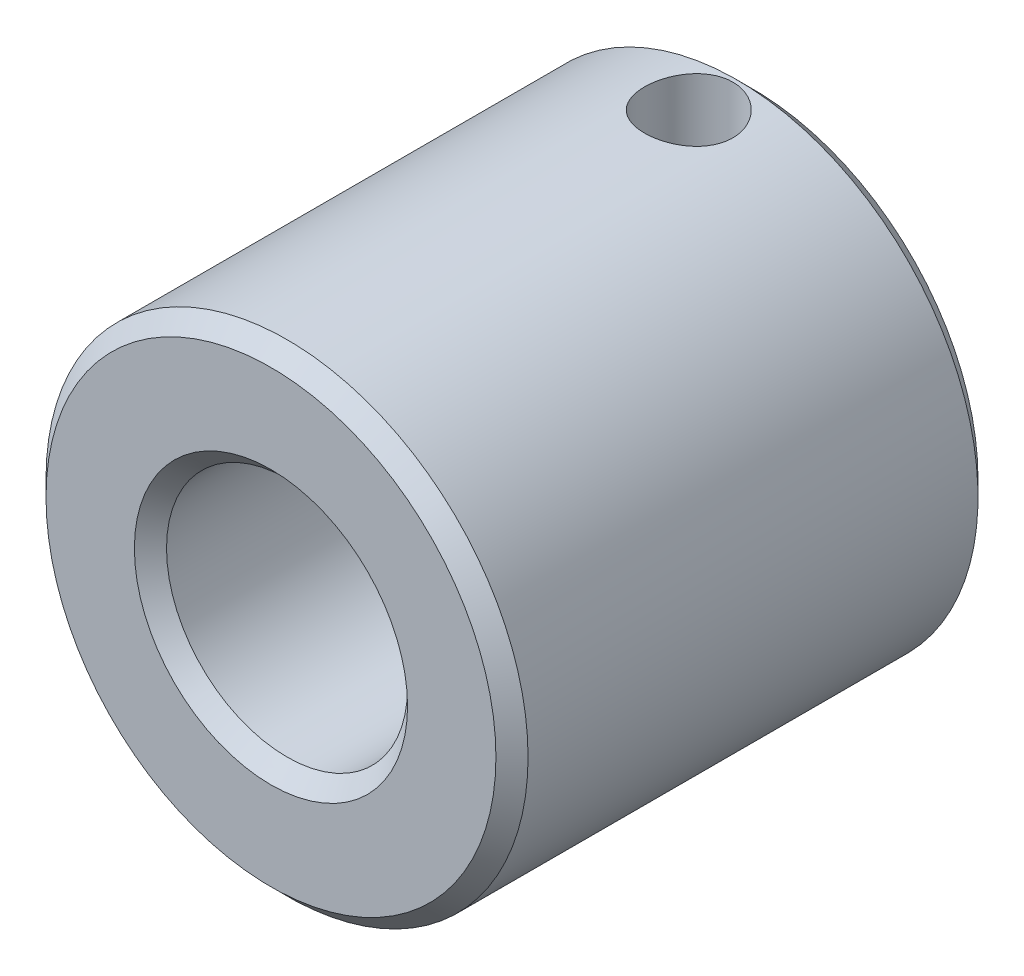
ISO-10303-21;
HEADER;
FILE_DESCRIPTION(('STEP AP214'),'2;1');
FILE_NAME('part.step','',(''),(''),'','','');
FILE_SCHEMA(('AUTOMOTIVE_DESIGN { 1 0 10303 214 1 1 1 1 }'));
ENDSEC;
DATA;
#1=APPLICATION_CONTEXT('core data for automotive mechanical design processes');
#2=APPLICATION_PROTOCOL_DEFINITION('international standard','automotive_design',2000,#1);
#3=PRODUCT_CONTEXT('',#1,'mechanical');
#4=PRODUCT('Part','Part','',(#3));
#5=PRODUCT_RELATED_PRODUCT_CATEGORY('part','',(#4));
#6=PRODUCT_DEFINITION_FORMATION('','',#4);
#7=PRODUCT_DEFINITION_CONTEXT('part definition',#1,'design');
#8=PRODUCT_DEFINITION('design','',#6,#7);
#9=PRODUCT_DEFINITION_SHAPE('','',#8);
#10=(LENGTH_UNIT() NAMED_UNIT(*) SI_UNIT(.MILLI.,.METRE.));
#11=(NAMED_UNIT(*) PLANE_ANGLE_UNIT() SI_UNIT($,.RADIAN.));
#12=(NAMED_UNIT(*) SI_UNIT($,.STERADIAN.) SOLID_ANGLE_UNIT());
#13=UNCERTAINTY_MEASURE_WITH_UNIT(LENGTH_MEASURE(1.E-05),#10,'distance_accuracy_value','');
#14=(GEOMETRIC_REPRESENTATION_CONTEXT(3) GLOBAL_UNCERTAINTY_ASSIGNED_CONTEXT((#13)) GLOBAL_UNIT_ASSIGNED_CONTEXT((#10,
#11,#12)) REPRESENTATION_CONTEXT('',''));
#15=CARTESIAN_POINT('',(0.,0.,0.));
#16=DIRECTION('',(0.,0.,1.));
#17=DIRECTION('',(1.,0.,0.));
#18=AXIS2_PLACEMENT_3D('',#15,#16,#17);
#19=CARTESIAN_POINT('',(0.,15.,4.));
#20=DIRECTION('',(0.,-1.,0.));
#21=DIRECTION('',(0.,0.,-1.));
#22=AXIS2_PLACEMENT_3D('',#19,#20,#21);
#23=CYLINDRICAL_SURFACE('',#22,2.75);
#24=CARTESIAN_POINT('',(0.,7.5,6.75));
#25=CARTESIAN_POINT('',(-0.148940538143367,7.49999352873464,6.74999142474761));
#26=CARTESIAN_POINT('',(-0.298023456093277,7.49551581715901,6.73784236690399));
#27=CARTESIAN_POINT('',(-0.591907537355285,7.47806168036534,6.68968220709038));
#28=CARTESIAN_POINT('',(-0.736701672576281,7.46507203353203,6.65363398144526));
#29=CARTESIAN_POINT('',(-1.01748356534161,7.43200265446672,6.55912290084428));
#30=CARTESIAN_POINT('',(-1.1534927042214,7.41194096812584,6.50071706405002));
#31=CARTESIAN_POINT('',(-1.41372538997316,7.36673932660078,6.36337496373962));
#32=CARTESIAN_POINT('',(-1.53794972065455,7.34159970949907,6.28444006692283));
#33=CARTESIAN_POINT('',(-1.77623945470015,7.28769181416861,6.10488555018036));
#34=CARTESIAN_POINT('',(-1.88975913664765,7.25882371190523,6.00357183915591));
#35=CARTESIAN_POINT('',(-2.09863505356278,7.20121473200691,5.78360544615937));
#36=CARTESIAN_POINT('',(-2.19398520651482,7.17247390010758,5.66494698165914));
#37=CARTESIAN_POINT('',(-2.367190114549,7.11723188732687,5.40844022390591));
#38=CARTESIAN_POINT('',(-2.4442900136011,7.09084883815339,5.2700542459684));
#39=CARTESIAN_POINT('',(-2.5738808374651,7.04484928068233,4.98115905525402));
#40=CARTESIAN_POINT('',(-2.62638115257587,7.02523019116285,4.83065449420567));
#41=CARTESIAN_POINT('',(-2.70315788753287,6.9960398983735,4.52804106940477));
#42=CARTESIAN_POINT('',(-2.72846858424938,6.98610193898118,4.37623115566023));
#43=CARTESIAN_POINT('',(-2.75338169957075,6.97632326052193,4.07021870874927));
#44=CARTESIAN_POINT('',(-2.75299416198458,6.97647859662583,3.91601713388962));
#45=CARTESIAN_POINT('',(-2.72731527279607,6.98655160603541,3.61892135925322));
#46=CARTESIAN_POINT('',(-2.70344009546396,6.9959141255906,3.47588248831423));
#47=CARTESIAN_POINT('',(-2.63379818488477,7.02242698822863,3.19600323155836));
#48=CARTESIAN_POINT('',(-2.58802821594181,7.03957848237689,3.05916376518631));
#49=CARTESIAN_POINT('',(-2.47508700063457,7.08008386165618,2.79261101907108));
#50=CARTESIAN_POINT('',(-2.40753734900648,7.10354609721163,2.66307526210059));
#51=CARTESIAN_POINT('',(-2.25322091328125,7.1539898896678,2.41676507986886));
#52=CARTESIAN_POINT('',(-2.16644861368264,7.18097245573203,2.29999433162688));
#53=CARTESIAN_POINT('',(-1.96961798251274,7.23752229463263,2.07467281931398));
#54=CARTESIAN_POINT('',(-1.85842614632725,7.26714456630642,1.96712380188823));
#55=CARTESIAN_POINT('',(-1.61919634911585,7.32415906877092,1.77187375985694));
#56=CARTESIAN_POINT('',(-1.49115075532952,7.35155028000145,1.68418177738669));
#57=CARTESIAN_POINT('',(-1.21934552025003,7.4015244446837,1.53008783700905));
#58=CARTESIAN_POINT('',(-1.07538060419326,7.42402988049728,1.46402169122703));
#59=CARTESIAN_POINT('',(-0.777495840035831,7.46109186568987,1.35747956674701));
#60=CARTESIAN_POINT('',(-0.623596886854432,7.47566452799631,1.31695168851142));
#61=CARTESIAN_POINT('',(-0.390189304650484,7.49024474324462,1.27669464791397));
#62=CARTESIAN_POINT('',(-0.312547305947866,7.49389085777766,1.26669827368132));
#63=CARTESIAN_POINT('',(-0.156616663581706,7.4987701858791,1.25334870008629));
#64=CARTESIAN_POINT('',(-0.0783280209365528,7.50000340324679,1.24999549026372));
#65=CARTESIAN_POINT('',(0.148940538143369,7.49999352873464,1.25000857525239));
#66=CARTESIAN_POINT('',(0.298023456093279,7.49551581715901,1.26215763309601));
#67=CARTESIAN_POINT('',(0.591907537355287,7.47806168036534,1.31031779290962));
#68=CARTESIAN_POINT('',(0.736701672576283,7.46507203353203,1.34636601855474));
#69=CARTESIAN_POINT('',(1.01748356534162,7.43200265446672,1.44087709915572));
#70=CARTESIAN_POINT('',(1.1534927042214,7.41194096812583,1.49928293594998));
#71=CARTESIAN_POINT('',(1.41372538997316,7.36673932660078,1.63662503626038));
#72=CARTESIAN_POINT('',(1.53794972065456,7.34159970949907,1.71555993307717));
#73=CARTESIAN_POINT('',(1.77623945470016,7.28769181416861,1.89511444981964));
#74=CARTESIAN_POINT('',(1.88975913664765,7.25882371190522,1.99642816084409));
#75=CARTESIAN_POINT('',(2.09863505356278,7.20121473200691,2.21639455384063));
#76=CARTESIAN_POINT('',(2.19398520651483,7.17247390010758,2.33505301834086));
#77=CARTESIAN_POINT('',(2.36719011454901,7.11723188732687,2.59155977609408));
#78=CARTESIAN_POINT('',(2.4442900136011,7.09084883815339,2.72994575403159));
#79=CARTESIAN_POINT('',(2.5738808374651,7.04484928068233,3.01884094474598));
#80=CARTESIAN_POINT('',(2.62638115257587,7.02523019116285,3.16934550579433));
#81=CARTESIAN_POINT('',(2.70315788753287,6.9960398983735,3.47195893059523));
#82=CARTESIAN_POINT('',(2.72846858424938,6.98610193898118,3.62376884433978));
#83=CARTESIAN_POINT('',(2.75338169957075,6.97632326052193,3.92978129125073));
#84=CARTESIAN_POINT('',(2.75299416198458,6.97647859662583,4.08398286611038));
#85=CARTESIAN_POINT('',(2.72731527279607,6.98655160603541,4.38107864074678));
#86=CARTESIAN_POINT('',(2.70344009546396,6.99591412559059,4.52411751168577));
#87=CARTESIAN_POINT('',(2.63379818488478,7.02242698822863,4.80399676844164));
#88=CARTESIAN_POINT('',(2.58802821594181,7.03957848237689,4.94083623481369));
#89=CARTESIAN_POINT('',(2.47508700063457,7.08008386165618,5.20738898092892));
#90=CARTESIAN_POINT('',(2.40753734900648,7.10354609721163,5.33692473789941));
#91=CARTESIAN_POINT('',(2.25322091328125,7.1539898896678,5.58323492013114));
#92=CARTESIAN_POINT('',(2.16644861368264,7.18097245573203,5.70000566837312));
#93=CARTESIAN_POINT('',(1.96961798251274,7.23752229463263,5.92532718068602));
#94=CARTESIAN_POINT('',(1.85842614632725,7.26714456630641,6.03287619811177));
#95=CARTESIAN_POINT('',(1.61919634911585,7.32415906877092,6.22812624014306));
#96=CARTESIAN_POINT('',(1.49115075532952,7.35155028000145,6.31581822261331));
#97=CARTESIAN_POINT('',(1.21934552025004,7.4015244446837,6.46991216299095));
#98=CARTESIAN_POINT('',(1.07538060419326,7.42402988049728,6.53597830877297));
#99=CARTESIAN_POINT('',(0.777495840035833,7.46109186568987,6.64252043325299));
#100=CARTESIAN_POINT('',(0.623596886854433,7.47566452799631,6.68304831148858));
#101=CARTESIAN_POINT('',(0.390189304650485,7.49024474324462,6.72330535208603));
#102=CARTESIAN_POINT('',(0.312547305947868,7.49389085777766,6.73330172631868));
#103=CARTESIAN_POINT('',(0.156616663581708,7.4987701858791,6.74665129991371));
#104=CARTESIAN_POINT('',(0.0783280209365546,7.50000340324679,6.75000450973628));
#105=CARTESIAN_POINT('',(0.,7.5,6.75));
#106=B_SPLINE_CURVE_WITH_KNOTS('',3,(#24,#25,#26,#27,#28,#29,#30,#31,#32,#33,#34,#35,#36,#37,
#38,#39,#40,#41,#42,#43,#44,#45,#46,#47,#48,#49,#50,#51,#52,#53,#54,#55,#56,#57,#58,#59,#60,#61,
#62,#63,#64,#65,#66,#67,#68,#69,#70,#71,#72,#73,#74,#75,#76,#77,#78,#79,#80,#81,#82,#83,#84,#85,
#86,#87,#88,#89,#90,#91,#92,#93,#94,#95,#96,#97,#98,#99,#100,#101,#102,#103,#104,#105),
.UNSPECIFIED.,.T.,.F.,(4,2,2,2,2,2,2,2,2,2,2,2,2,2,2,2,2,2,2,2,2,2,2,2,2,2,2,2,2,2,2,2,2,2,2,2,
2,2,2,2,4),(0.,0.446518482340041,0.893732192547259,1.33981290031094,1.78586391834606,
2.24841370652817,2.71111805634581,3.1905072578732,3.66971331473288,4.12996392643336,
4.59003465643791,5.02396622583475,5.45796194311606,5.89994577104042,6.34205658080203,
6.81241235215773,7.28298187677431,7.76054560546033,8.23713565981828,8.47196067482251,
8.70678532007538,9.15330380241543,9.60051751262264,10.0465982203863,10.4926492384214,
10.9551990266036,11.4179033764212,11.8972925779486,12.3764986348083,12.8367492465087,
13.2968199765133,13.7307515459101,14.1647472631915,14.6067310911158,15.0488419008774,
15.5191976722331,15.9897671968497,16.4673309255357,16.9439209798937,17.1787459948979,
17.4135706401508),.UNSPECIFIED.);
#107=CARTESIAN_POINT('',(0.,7.5,6.75));
#108=VERTEX_POINT('',#107);
#109=EDGE_CURVE('E45',#108,#108,#106,.T.);
#110=ORIENTED_EDGE('',*,*,#109,.T.);
#111=EDGE_LOOP('',(#110));
#112=FACE_BOUND('',#111,.T.);
#113=CARTESIAN_POINT('',(0.,15.,6.75));
#114=CARTESIAN_POINT('',(-0.152939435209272,14.9999967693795,6.74999281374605));
#115=CARTESIAN_POINT('',(-0.306071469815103,14.997634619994,6.7371870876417));
#116=CARTESIAN_POINT('',(-0.608143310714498,14.9884323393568,6.68629994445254));
#117=CARTESIAN_POINT('',(-0.757074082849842,14.9815832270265,6.64816783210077));
#118=CARTESIAN_POINT('',(-1.04615408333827,14.9641738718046,6.54782757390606));
#119=CARTESIAN_POINT('',(-1.18631467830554,14.9536185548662,6.48565137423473));
#120=CARTESIAN_POINT('',(-1.45415890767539,14.9299538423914,6.33906615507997));
#121=CARTESIAN_POINT('',(-1.58184691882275,14.9168453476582,6.25466497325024));
#122=CARTESIAN_POINT('',(-1.82266162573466,14.889350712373,6.06497899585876));
#123=CARTESIAN_POINT('',(-1.9356233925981,14.8749527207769,5.95948649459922));
#124=CARTESIAN_POINT('',(-2.14235500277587,14.8465898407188,5.73105441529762));
#125=CARTESIAN_POINT('',(-2.23612249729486,14.8326250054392,5.60811270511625));
#126=CARTESIAN_POINT('',(-2.40246884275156,14.8065968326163,5.34713206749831));
#127=CARTESIAN_POINT('',(-2.4748830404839,14.7945485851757,5.2089865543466));
#128=CARTESIAN_POINT('',(-2.59541249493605,14.7738822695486,4.92223450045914));
#129=CARTESIAN_POINT('',(-2.64352995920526,14.7652638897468,4.77362891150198));
#130=CARTESIAN_POINT('',(-2.71357913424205,14.7525507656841,4.47191721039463));
#131=CARTESIAN_POINT('',(-2.73579492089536,14.7484069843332,4.31887915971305));
#132=CARTESIAN_POINT('',(-2.75429165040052,14.7449642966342,4.01119574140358));
#133=CARTESIAN_POINT('',(-2.75057477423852,14.7456649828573,3.85655051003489));
#134=CARTESIAN_POINT('',(-2.71754232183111,14.751787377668,3.55209589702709));
#135=CARTESIAN_POINT('',(-2.68854917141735,14.7571496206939,3.40225016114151));
#136=CARTESIAN_POINT('',(-2.60629417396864,14.7718976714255,3.10958521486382));
#137=CARTESIAN_POINT('',(-2.55303114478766,14.7812836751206,2.96676634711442));
#138=CARTESIAN_POINT('',(-2.42342864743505,14.8030846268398,2.69125826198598));
#139=CARTESIAN_POINT('',(-2.34695749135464,14.815516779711,2.55863241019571));
#140=CARTESIAN_POINT('',(-2.17320882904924,14.8419965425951,2.30798340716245));
#141=CARTESIAN_POINT('',(-2.07593087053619,14.8560441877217,2.18996057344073));
#142=CARTESIAN_POINT('',(-1.86160679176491,14.8844299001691,1.97001308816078));
#143=CARTESIAN_POINT('',(-1.74428821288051,14.8987691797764,1.86835393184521));
#144=CARTESIAN_POINT('',(-1.4940603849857,14.9259369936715,1.68607542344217));
#145=CARTESIAN_POINT('',(-1.36114426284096,14.9387648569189,1.60546539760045));
#146=CARTESIAN_POINT('',(-1.08318739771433,14.9614900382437,1.46754334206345));
#147=CARTESIAN_POINT('',(-0.938123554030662,14.9713816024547,1.41027697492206));
#148=CARTESIAN_POINT('',(-0.640402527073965,14.9870605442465,1.32111261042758));
#149=CARTESIAN_POINT('',(-0.487762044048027,14.9928565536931,1.28916124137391));
#150=CARTESIAN_POINT('',(-0.278324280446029,14.9975209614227,1.26354988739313));
#151=CARTESIAN_POINT('',(-0.222792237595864,14.9984485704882,1.2584728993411));
#152=CARTESIAN_POINT('',(-0.111515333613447,14.999688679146,1.25169664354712));
#153=CARTESIAN_POINT('',(-0.0557704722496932,15.0000011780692,1.24999737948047));
#154=CARTESIAN_POINT('',(0.152939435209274,14.9999967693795,1.25000718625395));
#155=CARTESIAN_POINT('',(0.306071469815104,14.997634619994,1.2628129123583));
#156=CARTESIAN_POINT('',(0.6081433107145,14.9884323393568,1.31370005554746));
#157=CARTESIAN_POINT('',(0.757074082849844,14.9815832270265,1.35183216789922));
#158=CARTESIAN_POINT('',(1.04615408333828,14.9641738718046,1.45217242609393));
#159=CARTESIAN_POINT('',(1.18631467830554,14.9536185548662,1.51434862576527));
#160=CARTESIAN_POINT('',(1.45415890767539,14.9299538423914,1.66093384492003));
#161=CARTESIAN_POINT('',(1.58184691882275,14.9168453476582,1.74533502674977));
#162=CARTESIAN_POINT('',(1.82266162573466,14.889350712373,1.93502100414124));
#163=CARTESIAN_POINT('',(1.9356233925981,14.8749527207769,2.04051350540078));
#164=CARTESIAN_POINT('',(2.14235500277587,14.8465898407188,2.26894558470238));
#165=CARTESIAN_POINT('',(2.23612249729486,14.8326250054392,2.39188729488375));
#166=CARTESIAN_POINT('',(2.40246884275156,14.8065968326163,2.65286793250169));
#167=CARTESIAN_POINT('',(2.4748830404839,14.7945485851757,2.7910134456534));
#168=CARTESIAN_POINT('',(2.59541249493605,14.7738822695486,3.07776549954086));
#169=CARTESIAN_POINT('',(2.64352995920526,14.7652638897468,3.22637108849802));
#170=CARTESIAN_POINT('',(2.71357913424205,14.7525507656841,3.52808278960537));
#171=CARTESIAN_POINT('',(2.73579492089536,14.7484069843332,3.68112084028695));
#172=CARTESIAN_POINT('',(2.75429165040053,14.7449642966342,3.98880425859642));
#173=CARTESIAN_POINT('',(2.75057477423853,14.7456649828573,4.14344948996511));
#174=CARTESIAN_POINT('',(2.71754232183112,14.751787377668,4.44790410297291));
#175=CARTESIAN_POINT('',(2.68854917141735,14.7571496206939,4.59774983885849));
#176=CARTESIAN_POINT('',(2.60629417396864,14.7718976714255,4.89041478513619));
#177=CARTESIAN_POINT('',(2.55303114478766,14.7812836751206,5.03323365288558));
#178=CARTESIAN_POINT('',(2.42342864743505,14.8030846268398,5.30874173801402));
#179=CARTESIAN_POINT('',(2.34695749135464,14.815516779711,5.44136758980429));
#180=CARTESIAN_POINT('',(2.17320882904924,14.8419965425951,5.69201659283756));
#181=CARTESIAN_POINT('',(2.07593087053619,14.8560441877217,5.81003942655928));
#182=CARTESIAN_POINT('',(1.86160679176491,14.8844299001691,6.02998691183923));
#183=CARTESIAN_POINT('',(1.74428821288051,14.8987691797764,6.13164606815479));
#184=CARTESIAN_POINT('',(1.4940603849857,14.9259369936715,6.31392457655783));
#185=CARTESIAN_POINT('',(1.36114426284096,14.9387648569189,6.39453460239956));
#186=CARTESIAN_POINT('',(1.08318739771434,14.9614900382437,6.53245665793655));
#187=CARTESIAN_POINT('',(0.938123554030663,14.9713816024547,6.58972302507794));
#188=CARTESIAN_POINT('',(0.640402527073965,14.9870605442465,6.67888738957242));
#189=CARTESIAN_POINT('',(0.487762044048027,14.9928565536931,6.71083875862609));
#190=CARTESIAN_POINT('',(0.27832428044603,14.9975209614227,6.73645011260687));
#191=CARTESIAN_POINT('',(0.222792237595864,14.9984485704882,6.7415271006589));
#192=CARTESIAN_POINT('',(0.111515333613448,14.999688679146,6.74830335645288));
#193=CARTESIAN_POINT('',(0.055770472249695,15.0000011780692,6.75000262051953));
#194=CARTESIAN_POINT('',(0.,15.,6.75));
#195=B_SPLINE_CURVE_WITH_KNOTS('',3,(#113,#114,#115,#116,#117,#118,#119,#120,#121,#122,#123,
#124,#125,#126,#127,#128,#129,#130,#131,#132,#133,#134,#135,#136,#137,#138,#139,#140,#141,#142,
#143,#144,#145,#146,#147,#148,#149,#150,#151,#152,#153,#154,#155,#156,#157,#158,#159,#160,#161,
#162,#163,#164,#165,#166,#167,#168,#169,#170,#171,#172,#173,#174,#175,#176,#177,#178,#179,#180,
#181,#182,#183,#184,#185,#186,#187,#188,#189,#190,#191,#192,#193,#194),.UNSPECIFIED.,.T.,.F.,(4,
2,2,2,2,2,2,2,2,2,2,2,2,2,2,2,2,2,2,2,2,2,2,2,2,2,2,2,2,2,2,2,2,2,2,2,2,2,2,2,4),(0.,
0.458605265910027,0.918131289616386,1.37704885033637,1.83580478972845,2.2993232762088,
2.76289844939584,3.22995995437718,3.69697901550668,4.15882638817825,4.6206349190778,
5.07663738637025,5.53266206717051,5.99132430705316,6.44999651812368,6.91548961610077,
7.38118861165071,7.84779423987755,8.31341348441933,8.48064703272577,8.64788076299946,
9.10648602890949,9.56601205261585,10.0249296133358,10.4836855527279,10.9472040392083,
11.4107792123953,11.8778407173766,12.3448597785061,12.8067071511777,13.2685156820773,
13.7245181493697,14.18054283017,14.6392050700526,15.0978772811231,15.5633703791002,
16.0290693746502,16.495675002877,16.9612942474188,17.1285277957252,17.2957615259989),.UNSPECIFIED.);
#196=CARTESIAN_POINT('',(0.,15.,6.75));
#197=VERTEX_POINT('',#196);
#198=EDGE_CURVE('E44',#197,#197,#195,.T.);
#199=ORIENTED_EDGE('',*,*,#198,.F.);
#200=EDGE_LOOP('',(#199));
#201=FACE_BOUND('',#200,.T.);
#202=ADVANCED_FACE('F12',(#112,#201),#23,.F.);
#203=CARTESIAN_POINT('',(0.,0.,0.));
#204=DIRECTION('',(0.,0.,-1.));
#205=DIRECTION('',(-1.,0.,0.));
#206=AXIS2_PLACEMENT_3D('',#203,#204,#205);
#207=CYLINDRICAL_SURFACE('',#206,7.5);
#208=CARTESIAN_POINT('',(0.,0.,1.00000000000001));
#209=DIRECTION('',(0.,0.,-1.));
#210=DIRECTION('',(-1.,0.,0.));
#211=AXIS2_PLACEMENT_3D('',#208,#209,#210);
#212=CIRCLE('',#211,7.5);
#213=CARTESIAN_POINT('',(-7.5,0.,1.00000000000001));
#214=VERTEX_POINT('',#213);
#215=EDGE_CURVE('E23',#214,#214,#212,.T.);
#216=ORIENTED_EDGE('',*,*,#215,.T.);
#217=EDGE_LOOP('',(#216));
#218=FACE_BOUND('',#217,.T.);
#219=CARTESIAN_POINT('',(0.,0.,29.));
#220=DIRECTION('',(0.,0.,1.));
#221=DIRECTION('',(1.,0.,0.));
#222=AXIS2_PLACEMENT_3D('',#219,#220,#221);
#223=CIRCLE('',#222,7.5);
#224=CARTESIAN_POINT('',(7.5,0.,29.));
#225=VERTEX_POINT('',#224);
#226=EDGE_CURVE('E27',#225,#225,#223,.T.);
#227=ORIENTED_EDGE('',*,*,#226,.T.);
#228=EDGE_LOOP('',(#227));
#229=FACE_BOUND('',#228,.T.);
#230=ORIENTED_EDGE('',*,*,#109,.F.);
#231=EDGE_LOOP('',(#230));
#232=FACE_BOUND('',#231,.T.);
#233=ADVANCED_FACE('F59',(#218,#229,#232),#207,.F.);
#234=CARTESIAN_POINT('',(0.,15.,30.));
#235=DIRECTION('',(0.,0.,1.));
#236=DIRECTION('',(1.,0.,0.));
#237=AXIS2_PLACEMENT_3D('',#234,#235,#236);
#238=PLANE('',#237);
#239=CARTESIAN_POINT('',(0.,0.,30.));
#240=DIRECTION('',(0.,0.,1.));
#241=DIRECTION('',(1.,0.,0.));
#242=AXIS2_PLACEMENT_3D('',#239,#240,#241);
#243=CIRCLE('',#242,14.);
#244=CARTESIAN_POINT('',(14.,0.,30.));
#245=VERTEX_POINT('',#244);
#246=EDGE_CURVE('E8',#245,#245,#243,.T.);
#247=ORIENTED_EDGE('',*,*,#246,.T.);
#248=EDGE_LOOP('',(#247));
#249=FACE_BOUND('',#248,.T.);
#250=CARTESIAN_POINT('',(0.,0.,30.));
#251=DIRECTION('',(0.,0.,1.));
#252=DIRECTION('',(1.,0.,0.));
#253=AXIS2_PLACEMENT_3D('',#250,#251,#252);
#254=CIRCLE('',#253,8.5);
#255=CARTESIAN_POINT('',(8.5,0.,30.));
#256=VERTEX_POINT('',#255);
#257=EDGE_CURVE('E19',#256,#256,#254,.F.);
#258=ORIENTED_EDGE('',*,*,#257,.T.);
#259=EDGE_LOOP('',(#258));
#260=FACE_BOUND('',#259,.T.);
#261=ADVANCED_FACE('F63',(#249,#260),#238,.T.);
#262=CARTESIAN_POINT('',(0.,15.,0.));
#263=DIRECTION('',(0.,0.,-1.));
#264=DIRECTION('',(-1.,0.,0.));
#265=AXIS2_PLACEMENT_3D('',#262,#263,#264);
#266=PLANE('',#265);
#267=CARTESIAN_POINT('',(0.,0.,0.));
#268=DIRECTION('',(0.,0.,-1.));
#269=DIRECTION('',(-1.,0.,0.));
#270=AXIS2_PLACEMENT_3D('',#267,#268,#269);
#271=CIRCLE('',#270,14.);
#272=CARTESIAN_POINT('',(-14.,0.,0.));
#273=VERTEX_POINT('',#272);
#274=EDGE_CURVE('E32',#273,#273,#271,.T.);
#275=ORIENTED_EDGE('',*,*,#274,.T.);
#276=EDGE_LOOP('',(#275));
#277=FACE_BOUND('',#276,.T.);
#278=CARTESIAN_POINT('',(0.,0.,0.));
#279=DIRECTION('',(0.,0.,-1.));
#280=DIRECTION('',(-1.,0.,0.));
#281=AXIS2_PLACEMENT_3D('',#278,#279,#280);
#282=CIRCLE('',#281,8.5);
#283=CARTESIAN_POINT('',(-8.5,0.,0.));
#284=VERTEX_POINT('',#283);
#285=EDGE_CURVE('E35',#284,#284,#282,.F.);
#286=ORIENTED_EDGE('',*,*,#285,.T.);
#287=EDGE_LOOP('',(#286));
#288=FACE_BOUND('',#287,.T.);
#289=ADVANCED_FACE('F67',(#277,#288),#266,.T.);
#290=CARTESIAN_POINT('',(0.,0.,0.));
#291=DIRECTION('',(0.,0.,-1.));
#292=DIRECTION('',(-1.,0.,0.));
#293=AXIS2_PLACEMENT_3D('',#290,#291,#292);
#294=CYLINDRICAL_SURFACE('',#293,15.);
#295=CARTESIAN_POINT('',(0.,0.,1.));
#296=DIRECTION('',(0.,0.,-1.));
#297=DIRECTION('',(-1.,0.,0.));
#298=AXIS2_PLACEMENT_3D('',#295,#296,#297);
#299=CIRCLE('',#298,15.);
#300=CARTESIAN_POINT('',(-15.,0.,1.));
#301=VERTEX_POINT('',#300);
#302=EDGE_CURVE('E38',#301,#301,#299,.F.);
#303=ORIENTED_EDGE('',*,*,#302,.T.);
#304=EDGE_LOOP('',(#303));
#305=FACE_BOUND('',#304,.T.);
#306=CARTESIAN_POINT('',(0.,0.,29.));
#307=DIRECTION('',(0.,0.,1.));
#308=DIRECTION('',(1.,0.,0.));
#309=AXIS2_PLACEMENT_3D('',#306,#307,#308);
#310=CIRCLE('',#309,15.);
#311=CARTESIAN_POINT('',(15.,0.,29.));
#312=VERTEX_POINT('',#311);
#313=EDGE_CURVE('E41',#312,#312,#310,.F.);
#314=ORIENTED_EDGE('',*,*,#313,.T.);
#315=EDGE_LOOP('',(#314));
#316=FACE_BOUND('',#315,.T.);
#317=ORIENTED_EDGE('',*,*,#198,.T.);
#318=EDGE_LOOP('',(#317));
#319=FACE_BOUND('',#318,.T.);
#320=ADVANCED_FACE('F69',(#305,#316,#319),#294,.T.);
#321=CARTESIAN_POINT('',(0.,0.,1.));
#322=DIRECTION('',(0.,0.,1.));
#323=DIRECTION('',(1.,0.,0.));
#324=AXIS2_PLACEMENT_3D('',#321,#322,#323);
#325=CONICAL_SURFACE('',#324,15.,0.785398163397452);
#326=ORIENTED_EDGE('',*,*,#274,.F.);
#327=EDGE_LOOP('',(#326));
#328=FACE_BOUND('',#327,.T.);
#329=ORIENTED_EDGE('',*,*,#302,.F.);
#330=EDGE_LOOP('',(#329));
#331=FACE_BOUND('',#330,.T.);
#332=ADVANCED_FACE('F73',(#328,#331),#325,.T.);
#333=CARTESIAN_POINT('',(0.,0.,0.));
#334=DIRECTION('',(0.,0.,-1.));
#335=DIRECTION('',(-1.,0.,0.));
#336=AXIS2_PLACEMENT_3D('',#333,#334,#335);
#337=CONICAL_SURFACE('',#336,8.5,0.785398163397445);
#338=ORIENTED_EDGE('',*,*,#215,.F.);
#339=EDGE_LOOP('',(#338));
#340=FACE_BOUND('',#339,.T.);
#341=ORIENTED_EDGE('',*,*,#285,.F.);
#342=EDGE_LOOP('',(#341));
#343=FACE_BOUND('',#342,.T.);
#344=ADVANCED_FACE('F80',(#340,#343),#337,.F.);
#345=CARTESIAN_POINT('',(0.,0.,29.));
#346=DIRECTION('',(0.,0.,-1.));
#347=DIRECTION('',(-1.,0.,0.));
#348=AXIS2_PLACEMENT_3D('',#345,#346,#347);
#349=CONICAL_SURFACE('',#348,15.,0.785398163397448);
#350=ORIENTED_EDGE('',*,*,#246,.F.);
#351=EDGE_LOOP('',(#350));
#352=FACE_BOUND('',#351,.T.);
#353=ORIENTED_EDGE('',*,*,#313,.F.);
#354=EDGE_LOOP('',(#353));
#355=FACE_BOUND('',#354,.T.);
#356=ADVANCED_FACE('F135',(#352,#355),#349,.T.);
#357=CARTESIAN_POINT('',(0.,0.,30.));
#358=DIRECTION('',(0.,0.,1.));
#359=DIRECTION('',(1.,0.,0.));
#360=AXIS2_PLACEMENT_3D('',#357,#358,#359);
#361=CONICAL_SURFACE('',#360,8.5,0.785398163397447);
#362=ORIENTED_EDGE('',*,*,#226,.F.);
#363=EDGE_LOOP('',(#362));
#364=FACE_BOUND('',#363,.T.);
#365=ORIENTED_EDGE('',*,*,#257,.F.);
#366=EDGE_LOOP('',(#365));
#367=FACE_BOUND('',#366,.T.);
#368=ADVANCED_FACE('F14',(#364,#367),#361,.F.);
#369=CLOSED_SHELL('',(#202,#233,#261,#289,#320,#332,#344,#356,#368));
#370=MANIFOLD_SOLID_BREP('B1',#369);
#371=ADVANCED_BREP_SHAPE_REPRESENTATION('',(#18,#370),#14);
#372=SHAPE_DEFINITION_REPRESENTATION(#9,#371);
ENDSEC;
END-ISO-10303-21;
